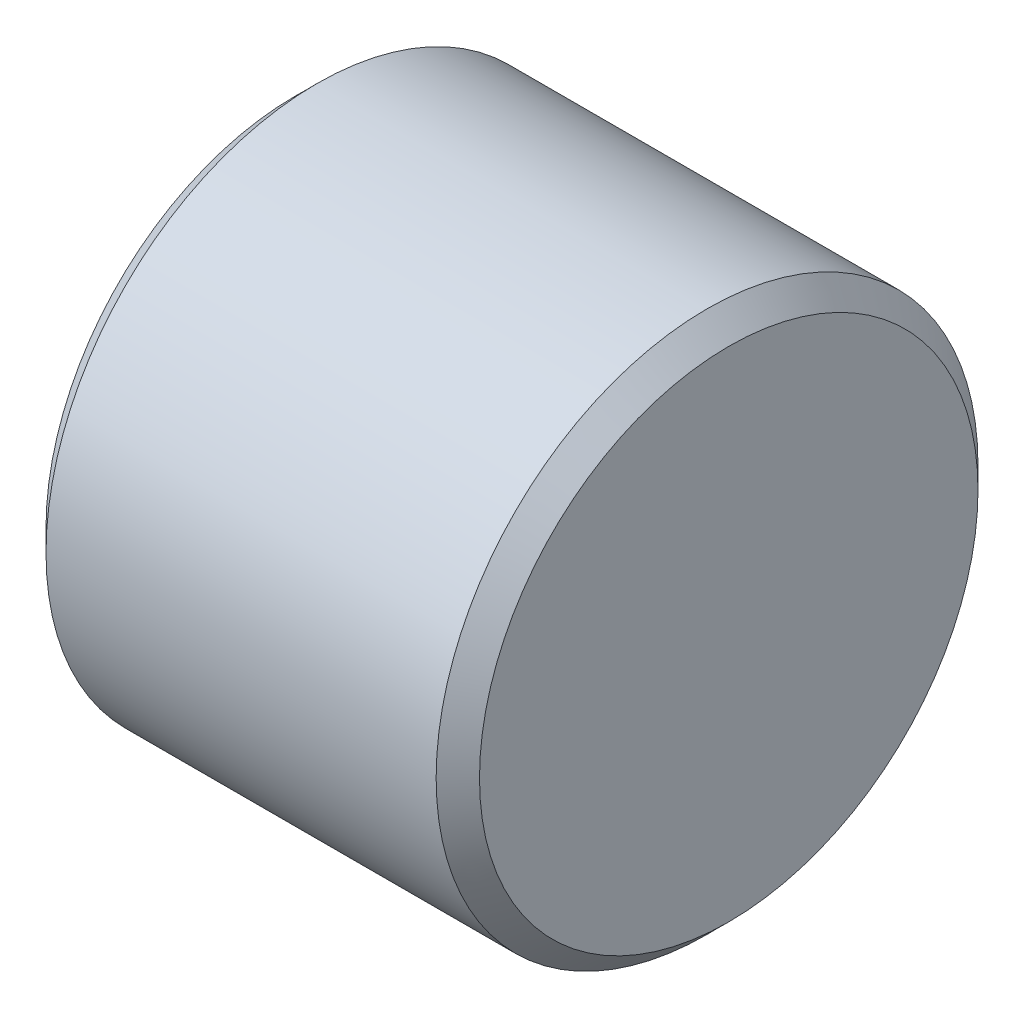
ISO-10303-21;
HEADER;
FILE_DESCRIPTION(('STEP AP214'),'2;1');
FILE_NAME('part.step','',(''),(''),'','','');
FILE_SCHEMA(('AUTOMOTIVE_DESIGN { 1 0 10303 214 1 1 1 1 }'));
ENDSEC;
DATA;
#1=APPLICATION_CONTEXT('core data for automotive mechanical design processes');
#2=APPLICATION_PROTOCOL_DEFINITION('international standard','automotive_design',2000,#1);
#3=PRODUCT_CONTEXT('',#1,'mechanical');
#4=PRODUCT('Part','Part','',(#3));
#5=PRODUCT_RELATED_PRODUCT_CATEGORY('part','',(#4));
#6=PRODUCT_DEFINITION_FORMATION('','',#4);
#7=PRODUCT_DEFINITION_CONTEXT('part definition',#1,'design');
#8=PRODUCT_DEFINITION('design','',#6,#7);
#9=PRODUCT_DEFINITION_SHAPE('','',#8);
#10=(LENGTH_UNIT() NAMED_UNIT(*) SI_UNIT(.MILLI.,.METRE.));
#11=(NAMED_UNIT(*) PLANE_ANGLE_UNIT() SI_UNIT($,.RADIAN.));
#12=(NAMED_UNIT(*) SI_UNIT($,.STERADIAN.) SOLID_ANGLE_UNIT());
#13=UNCERTAINTY_MEASURE_WITH_UNIT(LENGTH_MEASURE(1.E-05),#10,'distance_accuracy_value','');
#14=(GEOMETRIC_REPRESENTATION_CONTEXT(3) GLOBAL_UNCERTAINTY_ASSIGNED_CONTEXT((#13)) GLOBAL_UNIT_ASSIGNED_CONTEXT((#10,
#11,#12)) REPRESENTATION_CONTEXT('',''));
#15=CARTESIAN_POINT('',(0.,0.,0.));
#16=DIRECTION('',(0.,0.,1.));
#17=DIRECTION('',(1.,0.,0.));
#18=AXIS2_PLACEMENT_3D('',#15,#16,#17);
#19=CARTESIAN_POINT('',(0.,0.,0.));
#20=DIRECTION('',(1.,0.,0.));
#21=DIRECTION('',(0.,0.,-1.));
#22=AXIS2_PLACEMENT_3D('',#19,#20,#21);
#23=PLANE('',#22);
#24=CARTESIAN_POINT('',(-5.6843418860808E-11,0.,0.));
#25=DIRECTION('',(1.,0.,0.));
#26=DIRECTION('',(0.,0.,-1.));
#27=AXIS2_PLACEMENT_3D('',#24,#25,#26);
#28=CIRCLE('',#27,2.29999999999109);
#29=CARTESIAN_POINT('',(-5.6843418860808E-11,0.,-2.29999999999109));
#30=VERTEX_POINT('',#29);
#31=EDGE_CURVE('E17',#30,#30,#28,.T.);
#32=ORIENTED_EDGE('',*,*,#31,.F.);
#33=EDGE_LOOP('',(#32));
#34=FACE_BOUND('',#33,.T.);
#35=ADVANCED_FACE('F14',(#34),#23,.F.);
#36=CARTESIAN_POINT('',(4.,0.,0.));
#37=DIRECTION('',(1.,0.,0.));
#38=DIRECTION('',(0.,0.,-1.));
#39=AXIS2_PLACEMENT_3D('',#36,#37,#38);
#40=PLANE('',#39);
#41=CARTESIAN_POINT('',(3.99999999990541,0.,0.));
#42=DIRECTION('',(-1.,0.,0.));
#43=DIRECTION('',(0.,0.,1.));
#44=AXIS2_PLACEMENT_3D('',#41,#42,#43);
#45=CIRCLE('',#44,2.30000000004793);
#46=CARTESIAN_POINT('',(3.99999999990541,0.,2.30000000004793));
#47=VERTEX_POINT('',#46);
#48=EDGE_CURVE('E26',#47,#47,#45,.T.);
#49=ORIENTED_EDGE('',*,*,#48,.F.);
#50=EDGE_LOOP('',(#49));
#51=FACE_BOUND('',#50,.T.);
#52=ADVANCED_FACE('F37',(#51),#40,.T.);
#53=CARTESIAN_POINT('',(0.200000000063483,0.,0.));
#54=DIRECTION('',(1.,0.,0.));
#55=DIRECTION('',(0.,0.,-1.));
#56=AXIS2_PLACEMENT_3D('',#53,#54,#55);
#57=CONICAL_SURFACE('',#56,2.50000000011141,0.785398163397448);
#58=CARTESIAN_POINT('',(0.199999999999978,0.,0.));
#59=DIRECTION('',(1.,0.,0.));
#60=DIRECTION('',(0.,0.,-1.));
#61=AXIS2_PLACEMENT_3D('',#58,#59,#60);
#62=CIRCLE('',#61,2.5);
#63=CARTESIAN_POINT('',(0.199999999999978,0.,-2.5));
#64=VERTEX_POINT('',#63);
#65=EDGE_CURVE('E21',#64,#64,#62,.T.);
#66=ORIENTED_EDGE('',*,*,#65,.F.);
#67=EDGE_LOOP('',(#66));
#68=FACE_BOUND('',#67,.T.);
#69=ORIENTED_EDGE('',*,*,#31,.T.);
#70=EDGE_LOOP('',(#69));
#71=FACE_BOUND('',#70,.T.);
#72=ADVANCED_FACE('F34',(#68,#71),#57,.T.);
#73=CARTESIAN_POINT('',(3.80000000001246,0.,0.));
#74=DIRECTION('',(-1.,0.,0.));
#75=DIRECTION('',(0.,0.,1.));
#76=AXIS2_PLACEMENT_3D('',#73,#74,#75);
#77=CONICAL_SURFACE('',#76,2.49999999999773,0.785398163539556);
#78=CARTESIAN_POINT('',(3.80000000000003,0.,0.));
#79=DIRECTION('',(1.,0.,0.));
#80=DIRECTION('',(0.,0.,-1.));
#81=AXIS2_PLACEMENT_3D('',#78,#79,#80);
#82=CIRCLE('',#81,2.5);
#83=CARTESIAN_POINT('',(3.80000000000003,0.,-2.5));
#84=VERTEX_POINT('',#83);
#85=EDGE_CURVE('E10',#84,#84,#82,.F.);
#86=ORIENTED_EDGE('',*,*,#85,.F.);
#87=EDGE_LOOP('',(#86));
#88=FACE_BOUND('',#87,.T.);
#89=ORIENTED_EDGE('',*,*,#48,.T.);
#90=EDGE_LOOP('',(#89));
#91=FACE_BOUND('',#90,.T.);
#92=ADVANCED_FACE('F45',(#88,#91),#77,.T.);
#93=CARTESIAN_POINT('',(-0.199999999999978,0.,0.));
#94=DIRECTION('',(1.,0.,0.));
#95=DIRECTION('',(0.,0.,-1.));
#96=AXIS2_PLACEMENT_3D('',#93,#94,#95);
#97=CYLINDRICAL_SURFACE('',#96,2.5);
#98=ORIENTED_EDGE('',*,*,#85,.T.);
#99=EDGE_LOOP('',(#98));
#100=FACE_BOUND('',#99,.T.);
#101=ORIENTED_EDGE('',*,*,#65,.T.);
#102=EDGE_LOOP('',(#101));
#103=FACE_BOUND('',#102,.T.);
#104=ADVANCED_FACE('F43',(#100,#103),#97,.T.);
#105=CLOSED_SHELL('',(#35,#52,#72,#92,#104));
#106=MANIFOLD_SOLID_BREP('B1',#105);
#107=ADVANCED_BREP_SHAPE_REPRESENTATION('',(#18,#106),#14);
#108=SHAPE_DEFINITION_REPRESENTATION(#9,#107);
ENDSEC;
END-ISO-10303-21;
